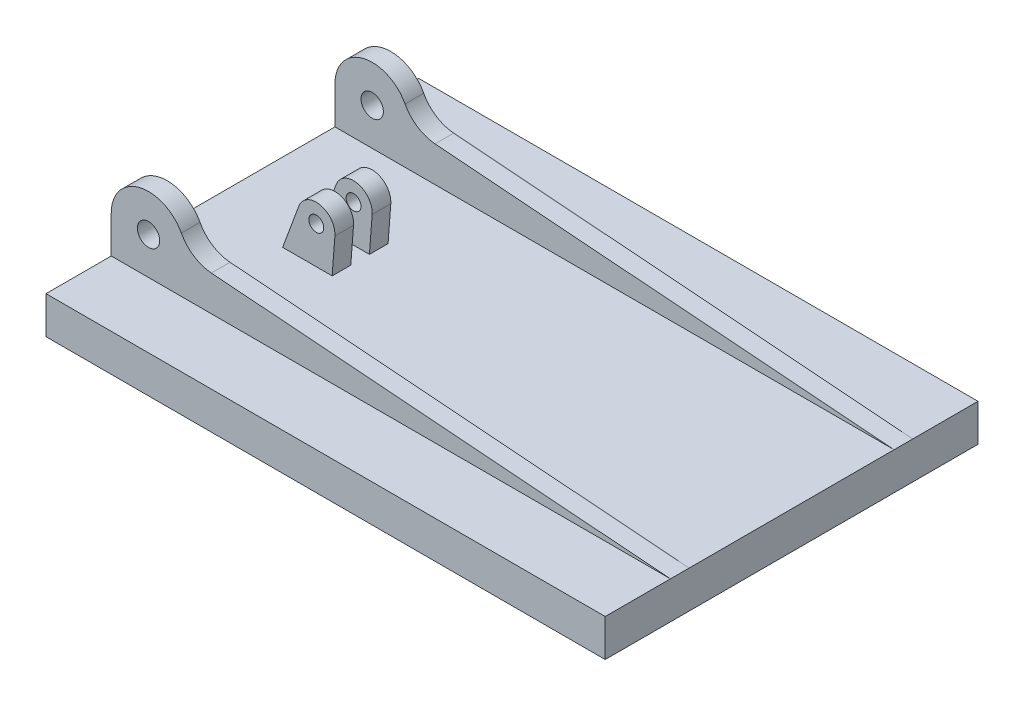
ISO-10303-21;
HEADER;
FILE_DESCRIPTION(('STEP AP214'),'2;1');
FILE_NAME('part.step','',(''),(''),'','','');
FILE_SCHEMA(('AUTOMOTIVE_DESIGN { 1 0 10303 214 1 1 1 1 }'));
ENDSEC;
DATA;
#1=APPLICATION_CONTEXT('core data for automotive mechanical design processes');
#2=APPLICATION_PROTOCOL_DEFINITION('international standard','automotive_design',2000,#1);
#3=PRODUCT_CONTEXT('',#1,'mechanical');
#4=PRODUCT('Part','Part','',(#3));
#5=PRODUCT_RELATED_PRODUCT_CATEGORY('part','',(#4));
#6=PRODUCT_DEFINITION_FORMATION('','',#4);
#7=PRODUCT_DEFINITION_CONTEXT('part definition',#1,'design');
#8=PRODUCT_DEFINITION('design','',#6,#7);
#9=PRODUCT_DEFINITION_SHAPE('','',#8);
#10=(LENGTH_UNIT() NAMED_UNIT(*) SI_UNIT(.MILLI.,.METRE.));
#11=(NAMED_UNIT(*) PLANE_ANGLE_UNIT() SI_UNIT($,.RADIAN.));
#12=(NAMED_UNIT(*) SI_UNIT($,.STERADIAN.) SOLID_ANGLE_UNIT());
#13=UNCERTAINTY_MEASURE_WITH_UNIT(LENGTH_MEASURE(1.E-05),#10,'distance_accuracy_value','');
#14=(GEOMETRIC_REPRESENTATION_CONTEXT(3) GLOBAL_UNCERTAINTY_ASSIGNED_CONTEXT((#13)) GLOBAL_UNIT_ASSIGNED_CONTEXT((#10,
#11,#12)) REPRESENTATION_CONTEXT('',''));
#15=CARTESIAN_POINT('',(0.,0.,0.));
#16=DIRECTION('',(0.,0.,1.));
#17=DIRECTION('',(1.,0.,0.));
#18=AXIS2_PLACEMENT_3D('',#15,#16,#17);
#19=CARTESIAN_POINT('',(0.,0.,500.));
#20=DIRECTION('',(0.,1.,0.));
#21=DIRECTION('',(0.,0.,1.));
#22=AXIS2_PLACEMENT_3D('',#19,#20,#21);
#23=PLANE('',#22);
#24=DIRECTION('',(1.,0.,0.));
#25=VECTOR('',#24,1.);
#26=CARTESIAN_POINT('',(209.766581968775,0.,-75.));
#27=LINE('',#26,#25);
#28=CARTESIAN_POINT('',(209.766581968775,0.,-75.));
#29=VERTEX_POINT('',#28);
#30=CARTESIAN_POINT('',(342.556636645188,0.,-75.));
#31=VERTEX_POINT('',#30);
#32=EDGE_CURVE('E184',#29,#31,#27,.T.);
#33=ORIENTED_EDGE('',*,*,#32,.T.);
#34=DIRECTION('',(0.,0.,1.));
#35=VECTOR('',#34,1.);
#36=CARTESIAN_POINT('',(342.556636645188,0.,-75.));
#37=LINE('',#36,#35);
#38=CARTESIAN_POINT('',(342.556636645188,0.,-25.));
#39=VERTEX_POINT('',#38);
#40=EDGE_CURVE('E751',#31,#39,#37,.T.);
#41=ORIENTED_EDGE('',*,*,#40,.T.);
#42=DIRECTION('',(1.,0.,0.));
#43=VECTOR('',#42,1.);
#44=CARTESIAN_POINT('',(209.766581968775,0.,-25.));
#45=LINE('',#44,#43);
#46=CARTESIAN_POINT('',(209.766581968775,0.,-25.));
#47=VERTEX_POINT('',#46);
#48=EDGE_CURVE('E205',#47,#39,#45,.T.);
#49=ORIENTED_EDGE('',*,*,#48,.F.);
#50=DIRECTION('',(0.,0.,1.));
#51=VECTOR('',#50,1.);
#52=CARTESIAN_POINT('',(209.766581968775,0.,-75.));
#53=LINE('',#52,#51);
#54=EDGE_CURVE('E199',#29,#47,#53,.T.);
#55=ORIENTED_EDGE('',*,*,#54,.F.);
#56=EDGE_LOOP('',(#33,#41,#49,#55));
#57=FACE_BOUND('',#56,.T.);
#58=DIRECTION('',(1.,0.,0.));
#59=VECTOR('',#58,1.);
#60=CARTESIAN_POINT('',(0.,0.,275.));
#61=LINE('',#60,#59);
#62=CARTESIAN_POINT('',(0.,0.,275.));
#63=VERTEX_POINT('',#62);
#64=CARTESIAN_POINT('',(1500.,0.,275.));
#65=VERTEX_POINT('',#64);
#66=EDGE_CURVE('E264',#63,#65,#61,.T.);
#67=ORIENTED_EDGE('',*,*,#66,.T.);
#68=DIRECTION('',(0.,0.,-1.));
#69=VECTOR('',#68,1.);
#70=CARTESIAN_POINT('',(1500.,0.,-500.));
#71=LINE('',#70,#69);
#72=CARTESIAN_POINT('',(1500.,0.,-275.));
#73=VERTEX_POINT('',#72);
#74=EDGE_CURVE('E370',#65,#73,#71,.T.);
#75=ORIENTED_EDGE('',*,*,#74,.T.);
#76=DIRECTION('',(1.,0.,0.));
#77=VECTOR('',#76,1.);
#78=CARTESIAN_POINT('',(0.,0.,-275.));
#79=LINE('',#78,#77);
#80=CARTESIAN_POINT('',(-1.72084568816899E-13,0.,-275.));
#81=VERTEX_POINT('',#80);
#82=EDGE_CURVE('E293',#81,#73,#79,.T.);
#83=ORIENTED_EDGE('',*,*,#82,.F.);
#84=DIRECTION('',(0.,0.,1.));
#85=VECTOR('',#84,1.);
#86=CARTESIAN_POINT('',(-2.22044604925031E-13,0.,-500.));
#87=LINE('',#86,#85);
#88=EDGE_CURVE('E348',#81,#63,#87,.T.);
#89=ORIENTED_EDGE('',*,*,#88,.T.);
#90=EDGE_LOOP('',(#67,#75,#83,#89));
#91=FACE_BOUND('',#90,.T.);
#92=DIRECTION('',(1.,0.,0.));
#93=VECTOR('',#92,1.);
#94=CARTESIAN_POINT('',(209.766581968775,0.,25.));
#95=LINE('',#94,#93);
#96=CARTESIAN_POINT('',(209.766581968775,0.,25.));
#97=VERTEX_POINT('',#96);
#98=CARTESIAN_POINT('',(342.556636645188,0.,25.));
#99=VERTEX_POINT('',#98);
#100=EDGE_CURVE('E56',#97,#99,#95,.T.);
#101=ORIENTED_EDGE('',*,*,#100,.T.);
#102=DIRECTION('',(0.,0.,-1.));
#103=VECTOR('',#102,1.);
#104=CARTESIAN_POINT('',(342.556636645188,0.,75.));
#105=LINE('',#104,#103);
#106=CARTESIAN_POINT('',(342.556636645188,0.,75.));
#107=VERTEX_POINT('',#106);
#108=EDGE_CURVE('E242',#107,#99,#105,.T.);
#109=ORIENTED_EDGE('',*,*,#108,.F.);
#110=DIRECTION('',(1.,0.,0.));
#111=VECTOR('',#110,1.);
#112=CARTESIAN_POINT('',(209.766581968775,0.,75.));
#113=LINE('',#112,#111);
#114=CARTESIAN_POINT('',(209.766581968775,0.,75.));
#115=VERTEX_POINT('',#114);
#116=EDGE_CURVE('E217',#115,#107,#113,.T.);
#117=ORIENTED_EDGE('',*,*,#116,.F.);
#118=DIRECTION('',(0.,0.,-1.));
#119=VECTOR('',#118,1.);
#120=CARTESIAN_POINT('',(209.766581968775,0.,75.));
#121=LINE('',#120,#119);
#122=EDGE_CURVE('E227',#115,#97,#121,.T.);
#123=ORIENTED_EDGE('',*,*,#122,.T.);
#124=EDGE_LOOP('',(#101,#109,#117,#123));
#125=FACE_BOUND('',#124,.T.);
#126=ADVANCED_FACE('F33',(#57,#91,#125),#23,.T.);
#127=CARTESIAN_POINT('',(1500.,0.,500.));
#128=VERTEX_POINT('',#127);
#129=CARTESIAN_POINT('',(1500.,0.,325.));
#130=VERTEX_POINT('',#129);
#131=EDGE_CURVE('E364',#128,#130,#71,.T.);
#132=ORIENTED_EDGE('',*,*,#131,.T.);
#133=DIRECTION('',(1.,0.,0.));
#134=VECTOR('',#133,1.);
#135=CARTESIAN_POINT('',(0.,0.,325.));
#136=LINE('',#135,#134);
#137=CARTESIAN_POINT('',(0.,0.,325.));
#138=VERTEX_POINT('',#137);
#139=EDGE_CURVE('E275',#138,#130,#136,.T.);
#140=ORIENTED_EDGE('',*,*,#139,.F.);
#141=CARTESIAN_POINT('',(0.,0.,500.));
#142=VERTEX_POINT('',#141);
#143=EDGE_CURVE('E327',#138,#142,#87,.T.);
#144=ORIENTED_EDGE('',*,*,#143,.T.);
#145=DIRECTION('',(1.,0.,0.));
#146=VECTOR('',#145,1.);
#147=CARTESIAN_POINT('',(0.,0.,500.));
#148=LINE('',#147,#146);
#149=EDGE_CURVE('E344',#142,#128,#148,.T.);
#150=ORIENTED_EDGE('',*,*,#149,.T.);
#151=EDGE_LOOP('',(#132,#140,#144,#150));
#152=FACE_BOUND('',#151,.T.);
#153=ADVANCED_FACE('F437',(#152),#23,.T.);
#154=CARTESIAN_POINT('',(-2.22044604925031E-13,0.,-500.));
#155=VERTEX_POINT('',#154);
#156=CARTESIAN_POINT('',(-1.83186799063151E-13,0.,-325.));
#157=VERTEX_POINT('',#156);
#158=EDGE_CURVE('E351',#155,#157,#87,.T.);
#159=ORIENTED_EDGE('',*,*,#158,.T.);
#160=DIRECTION('',(1.,0.,0.));
#161=VECTOR('',#160,1.);
#162=CARTESIAN_POINT('',(0.,0.,-325.));
#163=LINE('',#162,#161);
#164=CARTESIAN_POINT('',(1500.,0.,-325.));
#165=VERTEX_POINT('',#164);
#166=EDGE_CURVE('E318',#157,#165,#163,.T.);
#167=ORIENTED_EDGE('',*,*,#166,.T.);
#168=CARTESIAN_POINT('',(1500.,0.,-500.));
#169=VERTEX_POINT('',#168);
#170=EDGE_CURVE('E298',#165,#169,#71,.T.);
#171=ORIENTED_EDGE('',*,*,#170,.T.);
#172=DIRECTION('',(-1.,0.,0.));
#173=VECTOR('',#172,1.);
#174=CARTESIAN_POINT('',(-2.22044604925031E-13,0.,-500.));
#175=LINE('',#174,#173);
#176=EDGE_CURVE('E332',#169,#155,#175,.T.);
#177=ORIENTED_EDGE('',*,*,#176,.T.);
#178=EDGE_LOOP('',(#159,#167,#171,#177));
#179=FACE_BOUND('',#178,.T.);
#180=ADVANCED_FACE('F451',(#179),#23,.T.);
#181=CARTESIAN_POINT('',(-2.22044604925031E-13,-100.,-500.));
#182=DIRECTION('',(-1.,0.,0.));
#183=DIRECTION('',(0.,0.,1.));
#184=AXIS2_PLACEMENT_3D('',#181,#182,#183);
#185=PLANE('',#184);
#186=ORIENTED_EDGE('',*,*,#158,.F.);
#187=DIRECTION('',(0.,1.,0.));
#188=VECTOR('',#187,1.);
#189=CARTESIAN_POINT('',(-2.22044604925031E-13,-100.,-500.));
#190=LINE('',#189,#188);
#191=CARTESIAN_POINT('',(-2.22044604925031E-13,-100.,-500.));
#192=VERTEX_POINT('',#191);
#193=EDGE_CURVE('E360',#192,#155,#190,.T.);
#194=ORIENTED_EDGE('',*,*,#193,.F.);
#195=DIRECTION('',(0.,0.,1.));
#196=VECTOR('',#195,1.);
#197=CARTESIAN_POINT('',(-2.22044604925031E-13,-100.,-500.));
#198=LINE('',#197,#196);
#199=CARTESIAN_POINT('',(0.,-100.,500.));
#200=VERTEX_POINT('',#199);
#201=EDGE_CURVE('E328',#192,#200,#198,.T.);
#202=ORIENTED_EDGE('',*,*,#201,.T.);
#203=DIRECTION('',(0.,1.,0.));
#204=VECTOR('',#203,1.);
#205=CARTESIAN_POINT('',(0.,-100.,500.));
#206=LINE('',#205,#204);
#207=EDGE_CURVE('E341',#200,#142,#206,.T.);
#208=ORIENTED_EDGE('',*,*,#207,.T.);
#209=ORIENTED_EDGE('',*,*,#143,.F.);
#210=DIRECTION('',(0.,-1.,0.));
#211=VECTOR('',#210,1.);
#212=CARTESIAN_POINT('',(0.,100.,325.));
#213=LINE('',#212,#211);
#214=CARTESIAN_POINT('',(0.,100.,325.));
#215=VERTEX_POINT('',#214);
#216=EDGE_CURVE('E261',#215,#138,#213,.T.);
#217=ORIENTED_EDGE('',*,*,#216,.F.);
#218=DIRECTION('',(0.,0.,1.));
#219=VECTOR('',#218,1.);
#220=CARTESIAN_POINT('',(0.,100.,275.));
#221=LINE('',#220,#219);
#222=CARTESIAN_POINT('',(0.,100.,275.));
#223=VERTEX_POINT('',#222);
#224=EDGE_CURVE('E270',#223,#215,#221,.T.);
#225=ORIENTED_EDGE('',*,*,#224,.F.);
#226=DIRECTION('',(0.,-1.,0.));
#227=VECTOR('',#226,1.);
#228=CARTESIAN_POINT('',(0.,100.,275.));
#229=LINE('',#228,#227);
#230=EDGE_CURVE('E267',#223,#63,#229,.T.);
#231=ORIENTED_EDGE('',*,*,#230,.T.);
#232=ORIENTED_EDGE('',*,*,#88,.F.);
#233=DIRECTION('',(0.,-1.,0.));
#234=VECTOR('',#233,1.);
#235=CARTESIAN_POINT('',(0.,100.,-275.));
#236=LINE('',#235,#234);
#237=CARTESIAN_POINT('',(0.,100.,-275.));
#238=VERTEX_POINT('',#237);
#239=EDGE_CURVE('E287',#238,#81,#236,.T.);
#240=ORIENTED_EDGE('',*,*,#239,.F.);
#241=DIRECTION('',(0.,0.,-1.));
#242=VECTOR('',#241,1.);
#243=CARTESIAN_POINT('',(0.,100.,-275.));
#244=LINE('',#243,#242);
#245=CARTESIAN_POINT('',(0.,100.,-325.));
#246=VERTEX_POINT('',#245);
#247=EDGE_CURVE('E304',#238,#246,#244,.T.);
#248=ORIENTED_EDGE('',*,*,#247,.T.);
#249=DIRECTION('',(0.,-1.,0.));
#250=VECTOR('',#249,1.);
#251=CARTESIAN_POINT('',(0.,100.,-325.));
#252=LINE('',#251,#250);
#253=EDGE_CURVE('E315',#246,#157,#252,.T.);
#254=ORIENTED_EDGE('',*,*,#253,.T.);
#255=EDGE_LOOP('',(#186,#194,#202,#208,#209,#217,#225,#231,#232,#240,#248,#254));
#256=FACE_BOUND('',#255,.T.);
#257=ADVANCED_FACE('F434',(#256),#185,.T.);
#258=CARTESIAN_POINT('',(-2.22044604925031E-13,-100.,-500.));
#259=DIRECTION('',(0.,0.,-1.));
#260=DIRECTION('',(-1.,0.,0.));
#261=AXIS2_PLACEMENT_3D('',#258,#259,#260);
#262=PLANE('',#261);
#263=ORIENTED_EDGE('',*,*,#176,.F.);
#264=DIRECTION('',(0.,1.,0.));
#265=VECTOR('',#264,1.);
#266=CARTESIAN_POINT('',(1500.,-100.,-500.));
#267=LINE('',#266,#265);
#268=CARTESIAN_POINT('',(1500.,-100.,-500.));
#269=VERTEX_POINT('',#268);
#270=EDGE_CURVE('E357',#269,#169,#267,.T.);
#271=ORIENTED_EDGE('',*,*,#270,.F.);
#272=DIRECTION('',(-1.,0.,0.));
#273=VECTOR('',#272,1.);
#274=CARTESIAN_POINT('',(-2.22044604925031E-13,-100.,-500.));
#275=LINE('',#274,#273);
#276=EDGE_CURVE('E338',#269,#192,#275,.T.);
#277=ORIENTED_EDGE('',*,*,#276,.T.);
#278=ORIENTED_EDGE('',*,*,#193,.T.);
#279=EDGE_LOOP('',(#263,#271,#277,#278));
#280=FACE_BOUND('',#279,.T.);
#281=ADVANCED_FACE('F449',(#280),#262,.T.);
#282=CARTESIAN_POINT('',(1500.,-100.,-500.));
#283=DIRECTION('',(1.,0.,0.));
#284=DIRECTION('',(0.,0.,-1.));
#285=AXIS2_PLACEMENT_3D('',#282,#283,#284);
#286=PLANE('',#285);
#287=ORIENTED_EDGE('',*,*,#131,.F.);
#288=DIRECTION('',(0.,1.,0.));
#289=VECTOR('',#288,1.);
#290=CARTESIAN_POINT('',(1500.,-100.,500.));
#291=LINE('',#290,#289);
#292=CARTESIAN_POINT('',(1500.,-100.,500.));
#293=VERTEX_POINT('',#292);
#294=EDGE_CURVE('E355',#293,#128,#291,.T.);
#295=ORIENTED_EDGE('',*,*,#294,.F.);
#296=DIRECTION('',(0.,0.,-1.));
#297=VECTOR('',#296,1.);
#298=CARTESIAN_POINT('',(1500.,-100.,-500.));
#299=LINE('',#298,#297);
#300=EDGE_CURVE('E335',#293,#269,#299,.T.);
#301=ORIENTED_EDGE('',*,*,#300,.T.);
#302=ORIENTED_EDGE('',*,*,#270,.T.);
#303=ORIENTED_EDGE('',*,*,#170,.F.);
#304=DIRECTION('',(0.,0.,-1.));
#305=VECTOR('',#304,1.);
#306=CARTESIAN_POINT('',(1500.,0.,-275.));
#307=LINE('',#306,#305);
#308=EDGE_CURVE('E301',#73,#165,#307,.T.);
#309=ORIENTED_EDGE('',*,*,#308,.F.);
#310=ORIENTED_EDGE('',*,*,#74,.F.);
#311=DIRECTION('',(0.,0.,1.));
#312=VECTOR('',#311,1.);
#313=CARTESIAN_POINT('',(1500.,0.,275.));
#314=LINE('',#313,#312);
#315=EDGE_CURVE('E281',#65,#130,#314,.T.);
#316=ORIENTED_EDGE('',*,*,#315,.T.);
#317=EDGE_LOOP('',(#287,#295,#301,#302,#303,#309,#310,#316));
#318=FACE_BOUND('',#317,.T.);
#319=ADVANCED_FACE('F409',(#318),#286,.T.);
#320=CARTESIAN_POINT('',(0.,-100.,500.));
#321=DIRECTION('',(0.,0.,1.));
#322=DIRECTION('',(1.,0.,0.));
#323=AXIS2_PLACEMENT_3D('',#320,#321,#322);
#324=PLANE('',#323);
#325=ORIENTED_EDGE('',*,*,#149,.F.);
#326=ORIENTED_EDGE('',*,*,#207,.F.);
#327=DIRECTION('',(1.,0.,0.));
#328=VECTOR('',#327,1.);
#329=CARTESIAN_POINT('',(0.,-100.,500.));
#330=LINE('',#329,#328);
#331=EDGE_CURVE('E331',#200,#293,#330,.T.);
#332=ORIENTED_EDGE('',*,*,#331,.T.);
#333=ORIENTED_EDGE('',*,*,#294,.T.);
#334=EDGE_LOOP('',(#325,#326,#332,#333));
#335=FACE_BOUND('',#334,.T.);
#336=ADVANCED_FACE('F442',(#335),#324,.T.);
#337=CARTESIAN_POINT('',(0.,-100.,500.));
#338=DIRECTION('',(0.,1.,0.));
#339=DIRECTION('',(0.,0.,1.));
#340=AXIS2_PLACEMENT_3D('',#337,#338,#339);
#341=PLANE('',#340);
#342=ORIENTED_EDGE('',*,*,#201,.F.);
#343=ORIENTED_EDGE('',*,*,#276,.F.);
#344=ORIENTED_EDGE('',*,*,#300,.F.);
#345=ORIENTED_EDGE('',*,*,#331,.F.);
#346=EDGE_LOOP('',(#342,#343,#344,#345));
#347=FACE_BOUND('',#346,.T.);
#348=ADVANCED_FACE('F446',(#347),#341,.F.);
#349=CARTESIAN_POINT('',(100.,100.,-275.));
#350=DIRECTION('',(0.,0.,-1.));
#351=DIRECTION('',(-1.,0.,0.));
#352=AXIS2_PLACEMENT_3D('',#349,#350,#351);
#353=CYLINDRICAL_SURFACE('',#352,100.);
#354=CARTESIAN_POINT('',(100.,100.,-275.));
#355=DIRECTION('',(0.,0.,1.));
#356=DIRECTION('',(1.,0.,0.));
#357=AXIS2_PLACEMENT_3D('',#354,#355,#356);
#358=CIRCLE('',#357,100.);
#359=CARTESIAN_POINT('',(188.152964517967,147.212867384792,-275.));
#360=VERTEX_POINT('',#359);
#361=EDGE_CURVE('E285',#360,#238,#358,.T.);
#362=ORIENTED_EDGE('',*,*,#361,.F.);
#363=DIRECTION('',(0.,0.,-1.));
#364=VECTOR('',#363,1.);
#365=CARTESIAN_POINT('',(188.152964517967,147.212867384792,-275.));
#366=LINE('',#365,#364);
#367=CARTESIAN_POINT('',(188.152964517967,147.212867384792,-325.));
#368=VERTEX_POINT('',#367);
#369=EDGE_CURVE('E362',#360,#368,#366,.T.);
#370=ORIENTED_EDGE('',*,*,#369,.T.);
#371=CARTESIAN_POINT('',(100.,100.,-325.));
#372=DIRECTION('',(0.,0.,1.));
#373=DIRECTION('',(1.,0.,0.));
#374=AXIS2_PLACEMENT_3D('',#371,#372,#373);
#375=CIRCLE('',#374,100.);
#376=EDGE_CURVE('E284',#368,#246,#375,.T.);
#377=ORIENTED_EDGE('',*,*,#376,.T.);
#378=ORIENTED_EDGE('',*,*,#247,.F.);
#379=EDGE_LOOP('',(#362,#370,#377,#378));
#380=FACE_BOUND('',#379,.T.);
#381=ADVANCED_FACE('F429',(#380),#353,.T.);
#382=CARTESIAN_POINT('',(200.,100.,-275.));
#383=DIRECTION('',(-0.076696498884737,-0.997054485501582,0.));
#384=DIRECTION('',(0.997054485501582,-0.076696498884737,0.));
#385=AXIS2_PLACEMENT_3D('',#382,#383,#384);
#386=PLANE('',#385);
#387=DIRECTION('',(-0.997054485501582,0.076696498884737,0.));
#388=VECTOR('',#387,1.);
#389=CARTESIAN_POINT('',(200.,100.,-325.));
#390=LINE('',#389,#388);
#391=CARTESIAN_POINT('',(268.636279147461,94.7202862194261,-325.));
#392=VERTEX_POINT('',#391);
#393=EDGE_CURVE('E288',#165,#392,#390,.T.);
#394=ORIENTED_EDGE('',*,*,#393,.T.);
#395=DIRECTION('',(0.,0.,1.));
#396=VECTOR('',#395,1.);
#397=CARTESIAN_POINT('',(268.636279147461,94.7202862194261,-275.));
#398=LINE('',#397,#396);
#399=CARTESIAN_POINT('',(268.636279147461,94.7202862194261,-275.));
#400=VERTEX_POINT('',#399);
#401=EDGE_CURVE('E380',#392,#400,#398,.T.);
#402=ORIENTED_EDGE('',*,*,#401,.T.);
#403=DIRECTION('',(-0.997054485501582,0.076696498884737,0.));
#404=VECTOR('',#403,1.);
#405=CARTESIAN_POINT('',(200.,100.,-275.));
#406=LINE('',#405,#404);
#407=EDGE_CURVE('E297',#73,#400,#406,.T.);
#408=ORIENTED_EDGE('',*,*,#407,.F.);
#409=ORIENTED_EDGE('',*,*,#308,.T.);
#410=EDGE_LOOP('',(#394,#402,#408,#409));
#411=FACE_BOUND('',#410,.T.);
#412=ADVANCED_FACE('F421',(#411),#386,.F.);
#413=CARTESIAN_POINT('',(100.,100.,-275.));
#414=DIRECTION('',(0.,0.,1.));
#415=DIRECTION('',(1.,0.,0.));
#416=AXIS2_PLACEMENT_3D('',#413,#414,#415);
#417=PLANE('',#416);
#418=CARTESIAN_POINT('',(100.,100.,-275.));
#419=DIRECTION('',(0.,0.,1.));
#420=DIRECTION('',(1.,0.,0.));
#421=AXIS2_PLACEMENT_3D('',#418,#419,#420);
#422=CIRCLE('',#421,30.);
#423=CARTESIAN_POINT('',(130.,100.,-275.));
#424=VERTEX_POINT('',#423);
#425=EDGE_CURVE('E254',#424,#424,#422,.T.);
#426=ORIENTED_EDGE('',*,*,#425,.F.);
#427=EDGE_LOOP('',(#426));
#428=FACE_BOUND('',#427,.T.);
#429=ORIENTED_EDGE('',*,*,#407,.T.);
#430=CARTESIAN_POINT('',(276.305929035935,194.425734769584,-275.));
#431=DIRECTION('',(0.,0.,1.));
#432=DIRECTION('',(1.,0.,0.));
#433=AXIS2_PLACEMENT_3D('',#430,#431,#432);
#434=CIRCLE('',#433,100.);
#435=EDGE_CURVE('E389',#400,#360,#434,.F.);
#436=ORIENTED_EDGE('',*,*,#435,.T.);
#437=ORIENTED_EDGE('',*,*,#361,.T.);
#438=ORIENTED_EDGE('',*,*,#239,.T.);
#439=ORIENTED_EDGE('',*,*,#82,.T.);
#440=EDGE_LOOP('',(#429,#436,#437,#438,#439));
#441=FACE_BOUND('',#440,.T.);
#442=ADVANCED_FACE('F416',(#428,#441),#417,.T.);
#443=CARTESIAN_POINT('',(100.,100.,-325.));
#444=DIRECTION('',(0.,0.,1.));
#445=DIRECTION('',(1.,0.,0.));
#446=AXIS2_PLACEMENT_3D('',#443,#444,#445);
#447=PLANE('',#446);
#448=CARTESIAN_POINT('',(100.,100.,-325.));
#449=DIRECTION('',(0.,0.,1.));
#450=DIRECTION('',(1.,0.,0.));
#451=AXIS2_PLACEMENT_3D('',#448,#449,#450);
#452=CIRCLE('',#451,30.);
#453=CARTESIAN_POINT('',(130.,100.,-325.));
#454=VERTEX_POINT('',#453);
#455=EDGE_CURVE('E251',#454,#454,#452,.T.);
#456=ORIENTED_EDGE('',*,*,#455,.T.);
#457=EDGE_LOOP('',(#456));
#458=FACE_BOUND('',#457,.T.);
#459=ORIENTED_EDGE('',*,*,#376,.F.);
#460=CARTESIAN_POINT('',(276.305929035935,194.425734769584,-325.));
#461=DIRECTION('',(0.,0.,1.));
#462=DIRECTION('',(1.,0.,0.));
#463=AXIS2_PLACEMENT_3D('',#460,#461,#462);
#464=CIRCLE('',#463,100.);
#465=EDGE_CURVE('E387',#368,#392,#464,.T.);
#466=ORIENTED_EDGE('',*,*,#465,.T.);
#467=ORIENTED_EDGE('',*,*,#393,.F.);
#468=ORIENTED_EDGE('',*,*,#166,.F.);
#469=ORIENTED_EDGE('',*,*,#253,.F.);
#470=EDGE_LOOP('',(#459,#466,#467,#468,#469));
#471=FACE_BOUND('',#470,.T.);
#472=ADVANCED_FACE('F453',(#458,#471),#447,.F.);
#473=CARTESIAN_POINT('',(100.,100.,275.));
#474=DIRECTION('',(0.,0.,1.));
#475=DIRECTION('',(1.,0.,0.));
#476=AXIS2_PLACEMENT_3D('',#473,#474,#475);
#477=CYLINDRICAL_SURFACE('',#476,100.);
#478=CARTESIAN_POINT('',(100.,100.,325.));
#479=DIRECTION('',(0.,0.,1.));
#480=DIRECTION('',(1.,0.,0.));
#481=AXIS2_PLACEMENT_3D('',#478,#479,#480);
#482=CIRCLE('',#481,100.);
#483=CARTESIAN_POINT('',(188.152964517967,147.212867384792,325.));
#484=VERTEX_POINT('',#483);
#485=EDGE_CURVE('E257',#484,#215,#482,.T.);
#486=ORIENTED_EDGE('',*,*,#485,.F.);
#487=DIRECTION('',(0.,0.,1.));
#488=VECTOR('',#487,1.);
#489=CARTESIAN_POINT('',(188.152964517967,147.212867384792,275.));
#490=LINE('',#489,#488);
#491=CARTESIAN_POINT('',(188.152964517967,147.212867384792,275.));
#492=VERTEX_POINT('',#491);
#493=EDGE_CURVE('E385',#484,#492,#490,.F.);
#494=ORIENTED_EDGE('',*,*,#493,.T.);
#495=CARTESIAN_POINT('',(100.,100.,275.));
#496=DIRECTION('',(0.,0.,1.));
#497=DIRECTION('',(1.,0.,0.));
#498=AXIS2_PLACEMENT_3D('',#495,#496,#497);
#499=CIRCLE('',#498,100.);
#500=EDGE_CURVE('E258',#492,#223,#499,.T.);
#501=ORIENTED_EDGE('',*,*,#500,.T.);
#502=ORIENTED_EDGE('',*,*,#224,.T.);
#503=EDGE_LOOP('',(#486,#494,#501,#502));
#504=FACE_BOUND('',#503,.T.);
#505=ADVANCED_FACE('F397',(#504),#477,.T.);
#506=CARTESIAN_POINT('',(200.,100.,275.));
#507=DIRECTION('',(0.076696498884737,0.997054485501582,0.));
#508=DIRECTION('',(-0.997054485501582,0.076696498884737,0.));
#509=AXIS2_PLACEMENT_3D('',#506,#507,#508);
#510=PLANE('',#509);
#511=DIRECTION('',(-0.997054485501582,0.076696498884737,0.));
#512=VECTOR('',#511,1.);
#513=CARTESIAN_POINT('',(200.,100.,275.));
#514=LINE('',#513,#512);
#515=CARTESIAN_POINT('',(268.636279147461,94.7202862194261,275.));
#516=VERTEX_POINT('',#515);
#517=EDGE_CURVE('E260',#65,#516,#514,.T.);
#518=ORIENTED_EDGE('',*,*,#517,.T.);
#519=DIRECTION('',(0.,0.,-1.));
#520=VECTOR('',#519,1.);
#521=CARTESIAN_POINT('',(268.636279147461,94.7202862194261,325.));
#522=LINE('',#521,#520);
#523=CARTESIAN_POINT('',(268.636279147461,94.7202862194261,325.));
#524=VERTEX_POINT('',#523);
#525=EDGE_CURVE('E382',#516,#524,#522,.F.);
#526=ORIENTED_EDGE('',*,*,#525,.T.);
#527=DIRECTION('',(-0.997054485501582,0.076696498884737,0.));
#528=VECTOR('',#527,1.);
#529=CARTESIAN_POINT('',(200.,100.,325.));
#530=LINE('',#529,#528);
#531=EDGE_CURVE('E272',#130,#524,#530,.T.);
#532=ORIENTED_EDGE('',*,*,#531,.F.);
#533=ORIENTED_EDGE('',*,*,#315,.F.);
#534=EDGE_LOOP('',(#518,#526,#532,#533));
#535=FACE_BOUND('',#534,.T.);
#536=ADVANCED_FACE('F407',(#535),#510,.T.);
#537=CARTESIAN_POINT('',(100.,100.,275.));
#538=DIRECTION('',(0.,0.,-1.));
#539=DIRECTION('',(1.,0.,0.));
#540=AXIS2_PLACEMENT_3D('',#537,#538,#539);
#541=PLANE('',#540);
#542=CARTESIAN_POINT('',(100.,100.,275.));
#543=DIRECTION('',(0.,0.,-1.));
#544=DIRECTION('',(-1.,0.,0.));
#545=AXIS2_PLACEMENT_3D('',#542,#543,#544);
#546=CIRCLE('',#545,30.);
#547=CARTESIAN_POINT('',(70.,100.,275.));
#548=VERTEX_POINT('',#547);
#549=EDGE_CURVE('E248',#548,#548,#546,.T.);
#550=ORIENTED_EDGE('',*,*,#549,.F.);
#551=EDGE_LOOP('',(#550));
#552=FACE_BOUND('',#551,.T.);
#553=ORIENTED_EDGE('',*,*,#500,.F.);
#554=CARTESIAN_POINT('',(276.305929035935,194.425734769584,275.));
#555=DIRECTION('',(0.,0.,-1.));
#556=DIRECTION('',(-1.,0.,0.));
#557=AXIS2_PLACEMENT_3D('',#554,#555,#556);
#558=CIRCLE('',#557,100.);
#559=EDGE_CURVE('E11',#492,#516,#558,.F.);
#560=ORIENTED_EDGE('',*,*,#559,.T.);
#561=ORIENTED_EDGE('',*,*,#517,.F.);
#562=ORIENTED_EDGE('',*,*,#66,.F.);
#563=ORIENTED_EDGE('',*,*,#230,.F.);
#564=EDGE_LOOP('',(#553,#560,#561,#562,#563));
#565=FACE_BOUND('',#564,.T.);
#566=ADVANCED_FACE('F404',(#552,#565),#541,.T.);
#567=CARTESIAN_POINT('',(100.,100.,325.));
#568=DIRECTION('',(0.,0.,-1.));
#569=DIRECTION('',(1.,0.,0.));
#570=AXIS2_PLACEMENT_3D('',#567,#568,#569);
#571=PLANE('',#570);
#572=CARTESIAN_POINT('',(100.,100.,325.));
#573=DIRECTION('',(0.,0.,1.));
#574=DIRECTION('',(1.,0.,0.));
#575=AXIS2_PLACEMENT_3D('',#572,#573,#574);
#576=CIRCLE('',#575,30.);
#577=CARTESIAN_POINT('',(130.,100.,325.));
#578=VERTEX_POINT('',#577);
#579=EDGE_CURVE('E245',#578,#578,#576,.T.);
#580=ORIENTED_EDGE('',*,*,#579,.F.);
#581=EDGE_LOOP('',(#580));
#582=FACE_BOUND('',#581,.T.);
#583=ORIENTED_EDGE('',*,*,#531,.T.);
#584=CARTESIAN_POINT('',(276.305929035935,194.425734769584,325.));
#585=DIRECTION('',(0.,0.,-1.));
#586=DIRECTION('',(-1.,0.,0.));
#587=AXIS2_PLACEMENT_3D('',#584,#585,#586);
#588=CIRCLE('',#587,100.);
#589=EDGE_CURVE('E41',#524,#484,#588,.T.);
#590=ORIENTED_EDGE('',*,*,#589,.T.);
#591=ORIENTED_EDGE('',*,*,#485,.T.);
#592=ORIENTED_EDGE('',*,*,#216,.T.);
#593=ORIENTED_EDGE('',*,*,#139,.T.);
#594=EDGE_LOOP('',(#583,#590,#591,#592,#593));
#595=FACE_BOUND('',#594,.T.);
#596=ADVANCED_FACE('F392',(#582,#595),#571,.F.);
#597=CARTESIAN_POINT('',(100.,100.,-500.000025));
#598=DIRECTION('',(0.,0.,1.));
#599=DIRECTION('',(1.,0.,0.));
#600=AXIS2_PLACEMENT_3D('',#597,#598,#599);
#601=CYLINDRICAL_SURFACE('',#600,30.);
#602=ORIENTED_EDGE('',*,*,#549,.T.);
#603=EDGE_LOOP('',(#602));
#604=FACE_BOUND('',#603,.T.);
#605=ORIENTED_EDGE('',*,*,#579,.T.);
#606=EDGE_LOOP('',(#605));
#607=FACE_BOUND('',#606,.T.);
#608=ADVANCED_FACE('F491',(#604,#607),#601,.F.);
#609=ORIENTED_EDGE('',*,*,#425,.T.);
#610=EDGE_LOOP('',(#609));
#611=FACE_BOUND('',#610,.T.);
#612=ORIENTED_EDGE('',*,*,#455,.F.);
#613=EDGE_LOOP('',(#612));
#614=FACE_BOUND('',#613,.T.);
#615=ADVANCED_FACE('F485',(#611,#614),#601,.F.);
#616=CARTESIAN_POINT('',(276.305929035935,194.425734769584,-275.));
#617=DIRECTION('',(0.,0.,-1.));
#618=DIRECTION('',(-1.,0.,0.));
#619=AXIS2_PLACEMENT_3D('',#616,#617,#618);
#620=CYLINDRICAL_SURFACE('',#619,100.);
#621=ORIENTED_EDGE('',*,*,#435,.F.);
#622=ORIENTED_EDGE('',*,*,#401,.F.);
#623=ORIENTED_EDGE('',*,*,#465,.F.);
#624=ORIENTED_EDGE('',*,*,#369,.F.);
#625=EDGE_LOOP('',(#621,#622,#623,#624));
#626=FACE_BOUND('',#625,.T.);
#627=ADVANCED_FACE('F424',(#626),#620,.F.);
#628=CARTESIAN_POINT('',(276.305929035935,194.425734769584,275.));
#629=DIRECTION('',(0.,0.,1.));
#630=DIRECTION('',(1.,0.,0.));
#631=AXIS2_PLACEMENT_3D('',#628,#629,#630);
#632=CYLINDRICAL_SURFACE('',#631,100.);
#633=ORIENTED_EDGE('',*,*,#559,.F.);
#634=ORIENTED_EDGE('',*,*,#493,.F.);
#635=ORIENTED_EDGE('',*,*,#589,.F.);
#636=ORIENTED_EDGE('',*,*,#525,.F.);
#637=EDGE_LOOP('',(#633,#634,#635,#636));
#638=FACE_BOUND('',#637,.T.);
#639=ADVANCED_FACE('F35',(#638),#632,.F.);
#640=CARTESIAN_POINT('',(300.,100.,75.));
#641=DIRECTION('',(0.,0.,1.));
#642=DIRECTION('',(1.,0.,0.));
#643=AXIS2_PLACEMENT_3D('',#640,#641,#642);
#644=PLANE('',#643);
#645=ORIENTED_EDGE('',*,*,#116,.T.);
#646=DIRECTION('',(0.0756532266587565,0.99713418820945,0.));
#647=VECTOR('',#646,1.);
#648=CARTESIAN_POINT('',(342.556636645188,0.,75.));
#649=LINE('',#648,#647);
#650=CARTESIAN_POINT('',(349.856709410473,96.2173386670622,75.));
#651=VERTEX_POINT('',#650);
#652=EDGE_CURVE('E220',#107,#651,#649,.T.);
#653=ORIENTED_EDGE('',*,*,#652,.T.);
#654=CARTESIAN_POINT('',(300.,100.,75.));
#655=DIRECTION('',(0.,0.,1.));
#656=DIRECTION('',(1.,0.,0.));
#657=AXIS2_PLACEMENT_3D('',#654,#655,#656);
#658=CIRCLE('',#657,50.0000000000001);
#659=CARTESIAN_POINT('',(253.096594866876,117.32254562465,75.));
#660=VERTEX_POINT('',#659);
#661=EDGE_CURVE('E223',#651,#660,#658,.T.);
#662=ORIENTED_EDGE('',*,*,#661,.T.);
#663=DIRECTION('',(-0.346450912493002,-0.93806810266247,0.));
#664=VECTOR('',#663,1.);
#665=CARTESIAN_POINT('',(209.766581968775,0.,75.));
#666=LINE('',#665,#664);
#667=EDGE_CURVE('E225',#660,#115,#666,.T.);
#668=ORIENTED_EDGE('',*,*,#667,.T.);
#669=EDGE_LOOP('',(#645,#653,#662,#668));
#670=FACE_BOUND('',#669,.T.);
#671=CARTESIAN_POINT('',(300.,100.,75.));
#672=DIRECTION('',(0.,0.,1.));
#673=DIRECTION('',(1.,0.,0.));
#674=AXIS2_PLACEMENT_3D('',#671,#672,#673);
#675=CIRCLE('',#674,20.);
#676=CARTESIAN_POINT('',(320.,100.,75.));
#677=VERTEX_POINT('',#676);
#678=EDGE_CURVE('E209',#677,#677,#675,.T.);
#679=ORIENTED_EDGE('',*,*,#678,.F.);
#680=EDGE_LOOP('',(#679));
#681=FACE_BOUND('',#680,.T.);
#682=ADVANCED_FACE('F490',(#670,#681),#644,.T.);
#683=CARTESIAN_POINT('',(300.,100.,25.));
#684=DIRECTION('',(0.,0.,1.));
#685=DIRECTION('',(1.,0.,0.));
#686=AXIS2_PLACEMENT_3D('',#683,#684,#685);
#687=PLANE('',#686);
#688=ORIENTED_EDGE('',*,*,#100,.F.);
#689=DIRECTION('',(-0.346450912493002,-0.93806810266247,0.));
#690=VECTOR('',#689,1.);
#691=CARTESIAN_POINT('',(209.766581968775,0.,25.));
#692=LINE('',#691,#690);
#693=CARTESIAN_POINT('',(253.096594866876,117.32254562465,25.));
#694=VERTEX_POINT('',#693);
#695=EDGE_CURVE('E221',#694,#97,#692,.T.);
#696=ORIENTED_EDGE('',*,*,#695,.F.);
#697=CARTESIAN_POINT('',(300.,100.,25.));
#698=DIRECTION('',(0.,0.,1.));
#699=DIRECTION('',(1.,0.,0.));
#700=AXIS2_PLACEMENT_3D('',#697,#698,#699);
#701=CIRCLE('',#700,50.0000000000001);
#702=CARTESIAN_POINT('',(349.856709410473,96.2173386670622,25.));
#703=VERTEX_POINT('',#702);
#704=EDGE_CURVE('E231',#703,#694,#701,.T.);
#705=ORIENTED_EDGE('',*,*,#704,.F.);
#706=DIRECTION('',(0.0756532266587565,0.99713418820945,0.));
#707=VECTOR('',#706,1.);
#708=CARTESIAN_POINT('',(342.556636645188,0.,25.));
#709=LINE('',#708,#707);
#710=EDGE_CURVE('E229',#99,#703,#709,.T.);
#711=ORIENTED_EDGE('',*,*,#710,.F.);
#712=EDGE_LOOP('',(#688,#696,#705,#711));
#713=FACE_BOUND('',#712,.T.);
#714=CARTESIAN_POINT('',(300.,100.,25.));
#715=DIRECTION('',(0.,0.,1.));
#716=DIRECTION('',(1.,0.,0.));
#717=AXIS2_PLACEMENT_3D('',#714,#715,#716);
#718=CIRCLE('',#717,20.);
#719=CARTESIAN_POINT('',(320.,100.,25.));
#720=VERTEX_POINT('',#719);
#721=EDGE_CURVE('E206',#720,#720,#718,.T.);
#722=ORIENTED_EDGE('',*,*,#721,.T.);
#723=EDGE_LOOP('',(#722));
#724=FACE_BOUND('',#723,.T.);
#725=ADVANCED_FACE('F635',(#713,#724),#687,.F.);
#726=CARTESIAN_POINT('',(342.556636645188,0.,75.));
#727=DIRECTION('',(-0.99713418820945,0.0756532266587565,0.));
#728=DIRECTION('',(-0.0756532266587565,-0.99713418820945,0.));
#729=AXIS2_PLACEMENT_3D('',#726,#727,#728);
#730=PLANE('',#729);
#731=ORIENTED_EDGE('',*,*,#710,.T.);
#732=DIRECTION('',(0.,0.,-1.));
#733=VECTOR('',#732,1.);
#734=CARTESIAN_POINT('',(349.856709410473,96.2173386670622,75.));
#735=LINE('',#734,#733);
#736=EDGE_CURVE('E239',#651,#703,#735,.T.);
#737=ORIENTED_EDGE('',*,*,#736,.F.);
#738=ORIENTED_EDGE('',*,*,#652,.F.);
#739=ORIENTED_EDGE('',*,*,#108,.T.);
#740=EDGE_LOOP('',(#731,#737,#738,#739));
#741=FACE_BOUND('',#740,.T.);
#742=ADVANCED_FACE('F501',(#741),#730,.F.);
#743=CARTESIAN_POINT('',(300.,100.,75.));
#744=DIRECTION('',(0.,0.,-1.));
#745=DIRECTION('',(-1.,0.,0.));
#746=AXIS2_PLACEMENT_3D('',#743,#744,#745);
#747=CYLINDRICAL_SURFACE('',#746,50.0000000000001);
#748=ORIENTED_EDGE('',*,*,#704,.T.);
#749=DIRECTION('',(0.,0.,-1.));
#750=VECTOR('',#749,1.);
#751=CARTESIAN_POINT('',(253.096594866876,117.32254562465,75.));
#752=LINE('',#751,#750);
#753=EDGE_CURVE('E236',#660,#694,#752,.T.);
#754=ORIENTED_EDGE('',*,*,#753,.F.);
#755=ORIENTED_EDGE('',*,*,#661,.F.);
#756=ORIENTED_EDGE('',*,*,#736,.T.);
#757=EDGE_LOOP('',(#748,#754,#755,#756));
#758=FACE_BOUND('',#757,.T.);
#759=ADVANCED_FACE('F651',(#758),#747,.T.);
#760=CARTESIAN_POINT('',(209.766581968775,0.,75.));
#761=DIRECTION('',(0.93806810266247,-0.346450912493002,0.));
#762=DIRECTION('',(0.346450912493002,0.93806810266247,0.));
#763=AXIS2_PLACEMENT_3D('',#760,#761,#762);
#764=PLANE('',#763);
#765=ORIENTED_EDGE('',*,*,#695,.T.);
#766=ORIENTED_EDGE('',*,*,#122,.F.);
#767=ORIENTED_EDGE('',*,*,#667,.F.);
#768=ORIENTED_EDGE('',*,*,#753,.T.);
#769=EDGE_LOOP('',(#765,#766,#767,#768));
#770=FACE_BOUND('',#769,.T.);
#771=ADVANCED_FACE('F659',(#770),#764,.F.);
#772=CARTESIAN_POINT('',(300.,100.,75.));
#773=DIRECTION('',(0.,0.,-1.));
#774=DIRECTION('',(-1.,0.,0.));
#775=AXIS2_PLACEMENT_3D('',#772,#773,#774);
#776=CYLINDRICAL_SURFACE('',#775,20.);
#777=ORIENTED_EDGE('',*,*,#678,.T.);
#778=EDGE_LOOP('',(#777));
#779=FACE_BOUND('',#778,.T.);
#780=ORIENTED_EDGE('',*,*,#721,.F.);
#781=EDGE_LOOP('',(#780));
#782=FACE_BOUND('',#781,.T.);
#783=ADVANCED_FACE('F667',(#779,#782),#776,.F.);
#784=CARTESIAN_POINT('',(209.766581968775,0.,-75.));
#785=DIRECTION('',(-0.93806810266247,0.346450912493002,0.));
#786=DIRECTION('',(-0.346450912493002,-0.93806810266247,0.));
#787=AXIS2_PLACEMENT_3D('',#784,#785,#786);
#788=PLANE('',#787);
#789=DIRECTION('',(-0.346450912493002,-0.93806810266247,0.));
#790=VECTOR('',#789,1.);
#791=CARTESIAN_POINT('',(209.766581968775,0.,-25.));
#792=LINE('',#791,#790);
#793=CARTESIAN_POINT('',(253.096594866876,117.32254562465,-25.));
#794=VERTEX_POINT('',#793);
#795=EDGE_CURVE('E48',#794,#47,#792,.T.);
#796=ORIENTED_EDGE('',*,*,#795,.F.);
#797=DIRECTION('',(0.,0.,1.));
#798=VECTOR('',#797,1.);
#799=CARTESIAN_POINT('',(253.096594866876,117.32254562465,-75.));
#800=LINE('',#799,#798);
#801=CARTESIAN_POINT('',(253.096594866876,117.32254562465,-75.));
#802=VERTEX_POINT('',#801);
#803=EDGE_CURVE('E201',#802,#794,#800,.T.);
#804=ORIENTED_EDGE('',*,*,#803,.F.);
#805=DIRECTION('',(-0.346450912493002,-0.93806810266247,0.));
#806=VECTOR('',#805,1.);
#807=CARTESIAN_POINT('',(209.766581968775,0.,-75.));
#808=LINE('',#807,#806);
#809=EDGE_CURVE('E188',#802,#29,#808,.T.);
#810=ORIENTED_EDGE('',*,*,#809,.T.);
#811=ORIENTED_EDGE('',*,*,#54,.T.);
#812=EDGE_LOOP('',(#796,#804,#810,#811));
#813=FACE_BOUND('',#812,.T.);
#814=ADVANCED_FACE('F198',(#813),#788,.T.);
#815=CARTESIAN_POINT('',(300.,100.,-75.));
#816=DIRECTION('',(0.,0.,1.));
#817=DIRECTION('',(1.,0.,0.));
#818=AXIS2_PLACEMENT_3D('',#815,#816,#817);
#819=CYLINDRICAL_SURFACE('',#818,50.0000000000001);
#820=CARTESIAN_POINT('',(300.,100.,-25.));
#821=DIRECTION('',(0.,0.,1.));
#822=DIRECTION('',(1.,0.,0.));
#823=AXIS2_PLACEMENT_3D('',#820,#821,#822);
#824=CIRCLE('',#823,50.0000000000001);
#825=CARTESIAN_POINT('',(349.856709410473,96.2173386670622,-25.));
#826=VERTEX_POINT('',#825);
#827=EDGE_CURVE('E754',#826,#794,#824,.T.);
#828=ORIENTED_EDGE('',*,*,#827,.F.);
#829=DIRECTION('',(0.,0.,1.));
#830=VECTOR('',#829,1.);
#831=CARTESIAN_POINT('',(349.856709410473,96.2173386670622,-75.));
#832=LINE('',#831,#830);
#833=CARTESIAN_POINT('',(349.856709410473,96.2173386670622,-75.));
#834=VERTEX_POINT('',#833);
#835=EDGE_CURVE('E211',#834,#826,#832,.T.);
#836=ORIENTED_EDGE('',*,*,#835,.F.);
#837=CARTESIAN_POINT('',(300.,100.,-75.));
#838=DIRECTION('',(0.,0.,1.));
#839=DIRECTION('',(1.,0.,0.));
#840=AXIS2_PLACEMENT_3D('',#837,#838,#839);
#841=CIRCLE('',#840,50.0000000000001);
#842=EDGE_CURVE('E202',#834,#802,#841,.T.);
#843=ORIENTED_EDGE('',*,*,#842,.T.);
#844=ORIENTED_EDGE('',*,*,#803,.T.);
#845=EDGE_LOOP('',(#828,#836,#843,#844));
#846=FACE_BOUND('',#845,.T.);
#847=ADVANCED_FACE('F682',(#846),#819,.T.);
#848=CARTESIAN_POINT('',(342.556636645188,0.,-75.));
#849=DIRECTION('',(0.99713418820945,-0.0756532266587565,0.));
#850=DIRECTION('',(0.0756532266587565,0.99713418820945,0.));
#851=AXIS2_PLACEMENT_3D('',#848,#849,#850);
#852=PLANE('',#851);
#853=DIRECTION('',(0.0756532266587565,0.99713418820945,0.));
#854=VECTOR('',#853,1.);
#855=CARTESIAN_POINT('',(342.556636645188,0.,-25.));
#856=LINE('',#855,#854);
#857=EDGE_CURVE('E195',#39,#826,#856,.T.);
#858=ORIENTED_EDGE('',*,*,#857,.F.);
#859=ORIENTED_EDGE('',*,*,#40,.F.);
#860=DIRECTION('',(0.0756532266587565,0.99713418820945,0.));
#861=VECTOR('',#860,1.);
#862=CARTESIAN_POINT('',(342.556636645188,0.,-75.));
#863=LINE('',#862,#861);
#864=EDGE_CURVE('E191',#31,#834,#863,.T.);
#865=ORIENTED_EDGE('',*,*,#864,.T.);
#866=ORIENTED_EDGE('',*,*,#835,.T.);
#867=EDGE_LOOP('',(#858,#859,#865,#866));
#868=FACE_BOUND('',#867,.T.);
#869=ADVANCED_FACE('F690',(#868),#852,.T.);
#870=CARTESIAN_POINT('',(300.,100.,-75.));
#871=DIRECTION('',(0.,0.,-1.));
#872=DIRECTION('',(1.,0.,0.));
#873=AXIS2_PLACEMENT_3D('',#870,#871,#872);
#874=PLANE('',#873);
#875=CARTESIAN_POINT('',(300.,100.,-75.));
#876=DIRECTION('',(0.,0.,1.));
#877=DIRECTION('',(1.,0.,0.));
#878=AXIS2_PLACEMENT_3D('',#875,#876,#877);
#879=CIRCLE('',#878,20.);
#880=CARTESIAN_POINT('',(320.,100.,-75.));
#881=VERTEX_POINT('',#880);
#882=EDGE_CURVE('E742',#881,#881,#879,.T.);
#883=ORIENTED_EDGE('',*,*,#882,.T.);
#884=EDGE_LOOP('',(#883));
#885=FACE_BOUND('',#884,.T.);
#886=ORIENTED_EDGE('',*,*,#32,.F.);
#887=ORIENTED_EDGE('',*,*,#809,.F.);
#888=ORIENTED_EDGE('',*,*,#842,.F.);
#889=ORIENTED_EDGE('',*,*,#864,.F.);
#890=EDGE_LOOP('',(#886,#887,#888,#889));
#891=FACE_BOUND('',#890,.T.);
#892=ADVANCED_FACE('F186',(#885,#891),#874,.T.);
#893=CARTESIAN_POINT('',(300.,100.,-25.));
#894=DIRECTION('',(0.,0.,-1.));
#895=DIRECTION('',(1.,0.,0.));
#896=AXIS2_PLACEMENT_3D('',#893,#894,#895);
#897=PLANE('',#896);
#898=CARTESIAN_POINT('',(300.,100.,-25.));
#899=DIRECTION('',(0.,0.,1.));
#900=DIRECTION('',(1.,0.,0.));
#901=AXIS2_PLACEMENT_3D('',#898,#899,#900);
#902=CIRCLE('',#901,20.);
#903=CARTESIAN_POINT('',(320.,100.,-25.));
#904=VERTEX_POINT('',#903);
#905=EDGE_CURVE('E745',#904,#904,#902,.T.);
#906=ORIENTED_EDGE('',*,*,#905,.F.);
#907=EDGE_LOOP('',(#906));
#908=FACE_BOUND('',#907,.T.);
#909=ORIENTED_EDGE('',*,*,#48,.T.);
#910=ORIENTED_EDGE('',*,*,#857,.T.);
#911=ORIENTED_EDGE('',*,*,#827,.T.);
#912=ORIENTED_EDGE('',*,*,#795,.T.);
#913=EDGE_LOOP('',(#909,#910,#911,#912));
#914=FACE_BOUND('',#913,.T.);
#915=ADVANCED_FACE('F707',(#908,#914),#897,.F.);
#916=CARTESIAN_POINT('',(300.,100.,-75.));
#917=DIRECTION('',(0.,0.,1.));
#918=DIRECTION('',(1.,0.,0.));
#919=AXIS2_PLACEMENT_3D('',#916,#917,#918);
#920=CYLINDRICAL_SURFACE('',#919,20.);
#921=ORIENTED_EDGE('',*,*,#882,.F.);
#922=EDGE_LOOP('',(#921));
#923=FACE_BOUND('',#922,.T.);
#924=ORIENTED_EDGE('',*,*,#905,.T.);
#925=EDGE_LOOP('',(#924));
#926=FACE_BOUND('',#925,.T.);
#927=ADVANCED_FACE('F716',(#923,#926),#920,.F.);
#928=CLOSED_SHELL('',(#126,#153,#180,#257,#281,#319,#336,#348,#381,#412,#442,#472,#505,#536,
#566,#596,#608,#615,#627,#639,#682,#725,#742,#759,#771,#783,#814,#847,#869,#892,#915,#927));
#929=MANIFOLD_SOLID_BREP('B2',#928);
#930=ADVANCED_BREP_SHAPE_REPRESENTATION('',(#18,#929),#14);
#931=SHAPE_DEFINITION_REPRESENTATION(#9,#930);
ENDSEC;
END-ISO-10303-21;
